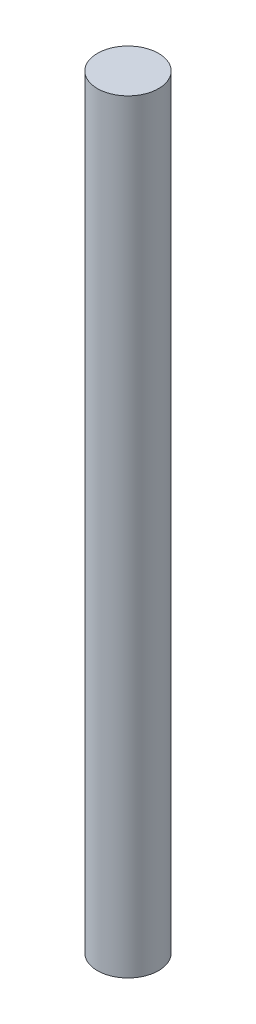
from build123d import *

# Parameters (mm, degrees)
SKETCH1_R           = 4
BOSS_EXTRUDE1_DEPTH = 100


with BuildPart() as part:
    # Sketch1 → Boss-Extrude1 (new body)
    with BuildSketch(Plane(origin=(0, 0, 0), x_dir=(1, 0, 0), z_dir=(0, 1, 0))):
        with Locations(Location((0, 0, 0), (0, 0, 270))):
            Circle(SKETCH1_R)
    extrude(amount=BOSS_EXTRUDE1_DEPTH)


solid = part.part
